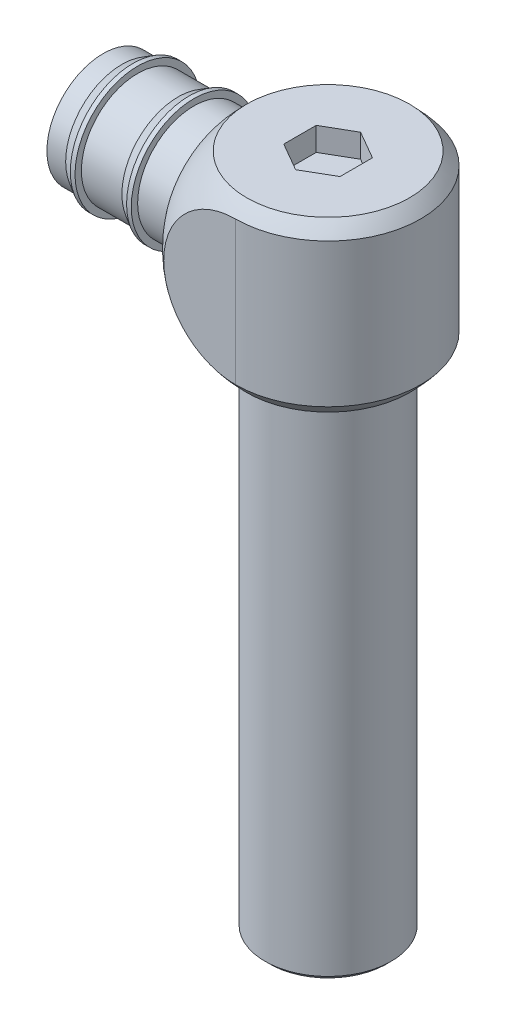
ISO-10303-21;
HEADER;
FILE_DESCRIPTION(('STEP AP214'),'2;1');
FILE_NAME('part.step','',(''),(''),'','','');
FILE_SCHEMA(('AUTOMOTIVE_DESIGN { 1 0 10303 214 1 1 1 1 }'));
ENDSEC;
DATA;
#1=APPLICATION_CONTEXT('core data for automotive mechanical design processes');
#2=APPLICATION_PROTOCOL_DEFINITION('international standard','automotive_design',2000,#1);
#3=PRODUCT_CONTEXT('',#1,'mechanical');
#4=PRODUCT('Part','Part','',(#3));
#5=PRODUCT_RELATED_PRODUCT_CATEGORY('part','',(#4));
#6=PRODUCT_DEFINITION_FORMATION('','',#4);
#7=PRODUCT_DEFINITION_CONTEXT('part definition',#1,'design');
#8=PRODUCT_DEFINITION('design','',#6,#7);
#9=PRODUCT_DEFINITION_SHAPE('','',#8);
#10=(LENGTH_UNIT() NAMED_UNIT(*) SI_UNIT(.MILLI.,.METRE.));
#11=(NAMED_UNIT(*) PLANE_ANGLE_UNIT() SI_UNIT($,.RADIAN.));
#12=(NAMED_UNIT(*) SI_UNIT($,.STERADIAN.) SOLID_ANGLE_UNIT());
#13=UNCERTAINTY_MEASURE_WITH_UNIT(LENGTH_MEASURE(1.E-05),#10,'distance_accuracy_value','');
#14=(GEOMETRIC_REPRESENTATION_CONTEXT(3) GLOBAL_UNCERTAINTY_ASSIGNED_CONTEXT((#13)) GLOBAL_UNIT_ASSIGNED_CONTEXT((#10,
#11,#12)) REPRESENTATION_CONTEXT('',''));
#15=CARTESIAN_POINT('',(0.,0.,0.));
#16=DIRECTION('',(0.,0.,1.));
#17=DIRECTION('',(1.,0.,0.));
#18=AXIS2_PLACEMENT_3D('',#15,#16,#17);
#19=CARTESIAN_POINT('',(0.,0.,0.));
#20=DIRECTION('',(1.,0.,0.));
#21=DIRECTION('',(0.,0.,-1.));
#22=AXIS2_PLACEMENT_3D('',#19,#20,#21);
#23=PLANE('',#22);
#24=CARTESIAN_POINT('',(0.,22.9489,0.));
#25=DIRECTION('',(1.,0.,0.));
#26=DIRECTION('',(0.,0.,-1.));
#27=AXIS2_PLACEMENT_3D('',#24,#25,#26);
#28=CIRCLE('',#27,8.255);
#29=CARTESIAN_POINT('',(0.,20.6814964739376,7.9375));
#30=VERTEX_POINT('',#29);
#31=CARTESIAN_POINT('',(0.,25.2163035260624,7.93749999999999));
#32=VERTEX_POINT('',#31);
#33=EDGE_CURVE('E218',#30,#32,#28,.F.);
#34=ORIENTED_EDGE('',*,*,#33,.T.);
#35=DIRECTION('',(0.,-1.,0.));
#36=VECTOR('',#35,1.);
#37=CARTESIAN_POINT('',(0.,31.2166,7.93749999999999));
#38=LINE('',#37,#36);
#39=EDGE_CURVE('E206',#32,#30,#38,.T.);
#40=ORIENTED_EDGE('',*,*,#39,.T.);
#41=EDGE_LOOP('',(#34,#40));
#42=FACE_BOUND('',#41,.T.);
#43=ADVANCED_FACE('F38',(#42),#23,.F.);
#44=CARTESIAN_POINT('',(-15.6845,3.10515,15.6845));
#45=DIRECTION('',(1.,0.,0.));
#46=DIRECTION('',(0.,0.,-1.));
#47=AXIS2_PLACEMENT_3D('',#44,#45,#46);
#48=PLANE('',#47);
#49=CARTESIAN_POINT('',(-15.6845,22.9489,0.));
#50=DIRECTION('',(1.,0.,0.));
#51=DIRECTION('',(0.,0.,-1.));
#52=AXIS2_PLACEMENT_3D('',#49,#50,#51);
#53=CIRCLE('',#52,10.715625);
#54=CARTESIAN_POINT('',(-15.6845,22.9489,-10.715625));
#55=VERTEX_POINT('',#54);
#56=EDGE_CURVE('E46',#55,#55,#53,.T.);
#57=ORIENTED_EDGE('',*,*,#56,.T.);
#58=EDGE_LOOP('',(#57));
#59=FACE_BOUND('',#58,.T.);
#60=CARTESIAN_POINT('',(-15.6845,22.9489,0.));
#61=DIRECTION('',(1.,0.,0.));
#62=DIRECTION('',(0.,0.,-1.));
#63=AXIS2_PLACEMENT_3D('',#60,#61,#62);
#64=CIRCLE('',#63,12.156104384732);
#65=CARTESIAN_POINT('',(-15.6845,22.9489,-12.156104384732));
#66=VERTEX_POINT('',#65);
#67=EDGE_CURVE('E254',#66,#66,#64,.F.);
#68=ORIENTED_EDGE('',*,*,#67,.T.);
#69=EDGE_LOOP('',(#68));
#70=FACE_BOUND('',#69,.T.);
#71=ADVANCED_FACE('F275',(#59,#70),#48,.F.);
#72=CARTESIAN_POINT('',(0.,22.9489,0.));
#73=DIRECTION('',(0.,-1.,0.));
#74=DIRECTION('',(1.,0.,0.));
#75=AXIS2_PLACEMENT_3D('',#72,#73,#74);
#76=SPHERICAL_SURFACE('',#75,19.84375);
#77=CARTESIAN_POINT('',(0.,8.6614,0.));
#78=DIRECTION('',(0.,-1.,0.));
#79=DIRECTION('',(1.,0.,0.));
#80=AXIS2_PLACEMENT_3D('',#77,#78,#79);
#81=CIRCLE('',#80,13.7710478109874);
#82=CARTESIAN_POINT('',(13.7710478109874,8.6614,0.));
#83=VERTEX_POINT('',#82);
#84=EDGE_CURVE('E246',#83,#83,#81,.F.);
#85=ORIENTED_EDGE('',*,*,#84,.T.);
#86=EDGE_LOOP('',(#85));
#87=FACE_BOUND('',#86,.T.);
#88=ORIENTED_EDGE('',*,*,#67,.F.);
#89=EDGE_LOOP('',(#88));
#90=FACE_BOUND('',#89,.T.);
#91=CARTESIAN_POINT('',(0.,22.9489,-15.6845));
#92=DIRECTION('',(0.,0.,1.));
#93=DIRECTION('',(1.,0.,0.));
#94=AXIS2_PLACEMENT_3D('',#91,#92,#93);
#95=CIRCLE('',#94,12.156104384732);
#96=CARTESIAN_POINT('',(0.,10.792795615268,-15.6845));
#97=VERTEX_POINT('',#96);
#98=CARTESIAN_POINT('',(0.,35.105004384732,-15.6845));
#99=VERTEX_POINT('',#98);
#100=EDGE_CURVE('E262',#97,#99,#95,.F.);
#101=ORIENTED_EDGE('',*,*,#100,.F.);
#102=CARTESIAN_POINT('',(0.,10.792795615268,0.));
#103=DIRECTION('',(0.,1.,0.));
#104=DIRECTION('',(0.,0.,1.));
#105=AXIS2_PLACEMENT_3D('',#102,#103,#104);
#106=CIRCLE('',#105,15.6845);
#107=CARTESIAN_POINT('',(0.,10.792795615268,15.6845));
#108=VERTEX_POINT('',#107);
#109=EDGE_CURVE('E260',#108,#97,#106,.T.);
#110=ORIENTED_EDGE('',*,*,#109,.F.);
#111=CARTESIAN_POINT('',(0.,22.9489,15.6845));
#112=DIRECTION('',(0.,0.,-1.));
#113=DIRECTION('',(-1.,0.,0.));
#114=AXIS2_PLACEMENT_3D('',#111,#112,#113);
#115=CIRCLE('',#114,12.156104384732);
#116=CARTESIAN_POINT('',(0.,35.105004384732,15.6845));
#117=VERTEX_POINT('',#116);
#118=EDGE_CURVE('E255',#117,#108,#115,.F.);
#119=ORIENTED_EDGE('',*,*,#118,.F.);
#120=CARTESIAN_POINT('',(0.,35.105004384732,0.));
#121=DIRECTION('',(0.,-1.,0.));
#122=DIRECTION('',(0.,0.,-1.));
#123=AXIS2_PLACEMENT_3D('',#120,#121,#122);
#124=CIRCLE('',#123,15.6845);
#125=EDGE_CURVE('E257',#99,#117,#124,.T.);
#126=ORIENTED_EDGE('',*,*,#125,.F.);
#127=EDGE_LOOP('',(#101,#110,#119,#126));
#128=FACE_BOUND('',#127,.T.);
#129=CARTESIAN_POINT('',(0.,37.2364,0.));
#130=DIRECTION('',(0.,1.,0.));
#131=DIRECTION('',(-1.,0.,0.));
#132=AXIS2_PLACEMENT_3D('',#129,#130,#131);
#133=CIRCLE('',#132,13.7710478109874);
#134=CARTESIAN_POINT('',(-13.7710478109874,37.2364,0.));
#135=VERTEX_POINT('',#134);
#136=EDGE_CURVE('E251',#135,#135,#133,.F.);
#137=ORIENTED_EDGE('',*,*,#136,.T.);
#138=EDGE_LOOP('',(#137));
#139=FACE_BOUND('',#138,.T.);
#140=ADVANCED_FACE('F312',(#87,#90,#128,#139),#76,.T.);
#141=CARTESIAN_POINT('',(0.,3.10515,-15.6845));
#142=DIRECTION('',(0.,0.,1.));
#143=DIRECTION('',(1.,0.,0.));
#144=AXIS2_PLACEMENT_3D('',#141,#142,#143);
#145=PLANE('',#144);
#146=ORIENTED_EDGE('',*,*,#100,.T.);
#147=DIRECTION('',(0.,-1.,0.));
#148=VECTOR('',#147,1.);
#149=CARTESIAN_POINT('',(0.,3.10515,-15.6845));
#150=LINE('',#149,#148);
#151=EDGE_CURVE('E250',#99,#97,#150,.T.);
#152=ORIENTED_EDGE('',*,*,#151,.T.);
#153=EDGE_LOOP('',(#146,#152));
#154=FACE_BOUND('',#153,.T.);
#155=ADVANCED_FACE('F382',(#154),#145,.F.);
#156=CARTESIAN_POINT('',(0.,3.10515,15.6845));
#157=DIRECTION('',(0.,0.,-1.));
#158=DIRECTION('',(-1.,0.,0.));
#159=AXIS2_PLACEMENT_3D('',#156,#157,#158);
#160=PLANE('',#159);
#161=ORIENTED_EDGE('',*,*,#118,.T.);
#162=DIRECTION('',(0.,-1.,0.));
#163=VECTOR('',#162,1.);
#164=CARTESIAN_POINT('',(0.,3.10515,15.6845));
#165=LINE('',#164,#163);
#166=EDGE_CURVE('E247',#117,#108,#165,.T.);
#167=ORIENTED_EDGE('',*,*,#166,.F.);
#168=EDGE_LOOP('',(#161,#167));
#169=FACE_BOUND('',#168,.T.);
#170=ADVANCED_FACE('F380',(#169),#160,.F.);
#171=CARTESIAN_POINT('',(0.,3.10515,0.));
#172=DIRECTION('',(0.,-1.,0.));
#173=DIRECTION('',(0.,0.,-1.));
#174=AXIS2_PLACEMENT_3D('',#171,#172,#173);
#175=CYLINDRICAL_SURFACE('',#174,15.6845);
#176=ORIENTED_EDGE('',*,*,#109,.T.);
#177=ORIENTED_EDGE('',*,*,#151,.F.);
#178=ORIENTED_EDGE('',*,*,#125,.T.);
#179=ORIENTED_EDGE('',*,*,#166,.T.);
#180=EDGE_LOOP('',(#176,#177,#178,#179));
#181=FACE_BOUND('',#180,.T.);
#182=ADVANCED_FACE('F378',(#181),#175,.T.);
#183=CARTESIAN_POINT('',(-25.4,8.6614,-15.6845));
#184=DIRECTION('',(0.,-1.,0.));
#185=DIRECTION('',(1.,0.,0.));
#186=AXIS2_PLACEMENT_3D('',#183,#184,#185);
#187=PLANE('',#186);
#188=CARTESIAN_POINT('',(0.,8.6614,0.));
#189=DIRECTION('',(0.,-1.,0.));
#190=DIRECTION('',(1.,0.,0.));
#191=AXIS2_PLACEMENT_3D('',#188,#189,#190);
#192=CIRCLE('',#191,10.668);
#193=CARTESIAN_POINT('',(10.668,8.6614,0.));
#194=VERTEX_POINT('',#193);
#195=EDGE_CURVE('E12',#194,#194,#192,.T.);
#196=ORIENTED_EDGE('',*,*,#195,.F.);
#197=EDGE_LOOP('',(#196));
#198=FACE_BOUND('',#197,.T.);
#199=ORIENTED_EDGE('',*,*,#84,.F.);
#200=EDGE_LOOP('',(#199));
#201=FACE_BOUND('',#200,.T.);
#202=ADVANCED_FACE('F374',(#198,#201),#187,.T.);
#203=CARTESIAN_POINT('',(-25.4,37.2364,-15.6845));
#204=DIRECTION('',(0.,1.,0.));
#205=DIRECTION('',(-1.,0.,0.));
#206=AXIS2_PLACEMENT_3D('',#203,#204,#205);
#207=PLANE('',#206);
#208=DIRECTION('',(0.866025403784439,0.,-0.5));
#209=VECTOR('',#208,1.);
#210=CARTESIAN_POINT('',(0.,37.2364,5.49926131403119));
#211=LINE('',#210,#209);
#212=CARTESIAN_POINT('',(0.,37.2364,5.49926131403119));
#213=VERTEX_POINT('',#212);
#214=CARTESIAN_POINT('',(4.7625,37.2364,2.74963065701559));
#215=VERTEX_POINT('',#214);
#216=EDGE_CURVE('E53',#213,#215,#211,.T.);
#217=ORIENTED_EDGE('',*,*,#216,.F.);
#218=DIRECTION('',(0.866025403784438,0.,0.5));
#219=VECTOR('',#218,1.);
#220=CARTESIAN_POINT('',(-4.76249999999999,37.2364,2.74963065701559));
#221=LINE('',#220,#219);
#222=CARTESIAN_POINT('',(-4.76249999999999,37.2364,2.74963065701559));
#223=VERTEX_POINT('',#222);
#224=EDGE_CURVE('E136',#223,#213,#221,.T.);
#225=ORIENTED_EDGE('',*,*,#224,.F.);
#226=DIRECTION('',(0.,0.,1.));
#227=VECTOR('',#226,1.);
#228=CARTESIAN_POINT('',(-4.76249999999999,37.2364,-2.74963065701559));
#229=LINE('',#228,#227);
#230=CARTESIAN_POINT('',(-4.76249999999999,37.2364,-2.74963065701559));
#231=VERTEX_POINT('',#230);
#232=EDGE_CURVE('E139',#231,#223,#229,.T.);
#233=ORIENTED_EDGE('',*,*,#232,.F.);
#234=DIRECTION('',(-0.866025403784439,0.,0.5));
#235=VECTOR('',#234,1.);
#236=CARTESIAN_POINT('',(0.,37.2364,-5.49926131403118));
#237=LINE('',#236,#235);
#238=CARTESIAN_POINT('',(0.,37.2364,-5.49926131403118));
#239=VERTEX_POINT('',#238);
#240=EDGE_CURVE('E155',#239,#231,#237,.T.);
#241=ORIENTED_EDGE('',*,*,#240,.F.);
#242=DIRECTION('',(-0.866025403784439,0.,-0.5));
#243=VECTOR('',#242,1.);
#244=CARTESIAN_POINT('',(4.7625,37.2364,-2.74963065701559));
#245=LINE('',#244,#243);
#246=CARTESIAN_POINT('',(4.7625,37.2364,-2.74963065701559));
#247=VERTEX_POINT('',#246);
#248=EDGE_CURVE('E152',#247,#239,#245,.T.);
#249=ORIENTED_EDGE('',*,*,#248,.F.);
#250=DIRECTION('',(0.,0.,-1.));
#251=VECTOR('',#250,1.);
#252=CARTESIAN_POINT('',(4.7625,37.2364,2.74963065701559));
#253=LINE('',#252,#251);
#254=EDGE_CURVE('E150',#215,#247,#253,.T.);
#255=ORIENTED_EDGE('',*,*,#254,.F.);
#256=EDGE_LOOP('',(#217,#225,#233,#241,#249,#255));
#257=FACE_BOUND('',#256,.T.);
#258=ORIENTED_EDGE('',*,*,#136,.F.);
#259=EDGE_LOOP('',(#258));
#260=FACE_BOUND('',#259,.T.);
#261=ADVANCED_FACE('F288',(#257,#260),#207,.T.);
#262=CARTESIAN_POINT('',(0.,22.9489,0.));
#263=DIRECTION('',(-1.,0.,0.));
#264=DIRECTION('',(0.,0.,1.));
#265=AXIS2_PLACEMENT_3D('',#262,#263,#264);
#266=CYLINDRICAL_SURFACE('',#265,9.525);
#267=CARTESIAN_POINT('',(-16.875125,22.9489,0.));
#268=DIRECTION('',(1.,0.,0.));
#269=DIRECTION('',(0.,0.,-1.));
#270=AXIS2_PLACEMENT_3D('',#267,#268,#269);
#271=CIRCLE('',#270,9.525);
#272=CARTESIAN_POINT('',(-16.875125,22.9489,-9.525));
#273=VERTEX_POINT('',#272);
#274=EDGE_CURVE('E264',#273,#273,#271,.F.);
#275=ORIENTED_EDGE('',*,*,#274,.T.);
#276=EDGE_LOOP('',(#275));
#277=FACE_BOUND('',#276,.T.);
#278=CARTESIAN_POINT('',(-22.7365011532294,22.9489,0.));
#279=DIRECTION('',(-1.,0.,0.));
#280=DIRECTION('',(0.,0.,1.));
#281=AXIS2_PLACEMENT_3D('',#278,#279,#280);
#282=CIRCLE('',#281,9.525);
#283=CARTESIAN_POINT('',(-22.7365011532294,22.9489,9.525));
#284=VERTEX_POINT('',#283);
#285=EDGE_CURVE('E222',#284,#284,#282,.T.);
#286=ORIENTED_EDGE('',*,*,#285,.F.);
#287=EDGE_LOOP('',(#286));
#288=FACE_BOUND('',#287,.T.);
#289=ADVANCED_FACE('F284',(#277,#288),#266,.T.);
#290=CARTESIAN_POINT('',(0.,22.9489,0.));
#291=DIRECTION('',(-1.,0.,0.));
#292=DIRECTION('',(0.,0.,1.));
#293=AXIS2_PLACEMENT_3D('',#290,#291,#292);
#294=CYLINDRICAL_SURFACE('',#293,9.525);
#295=CARTESIAN_POINT('',(-38.1,22.9489,0.));
#296=DIRECTION('',(-1.,0.,0.));
#297=DIRECTION('',(0.,0.,1.));
#298=AXIS2_PLACEMENT_3D('',#295,#296,#297);
#299=CIRCLE('',#298,9.525);
#300=CARTESIAN_POINT('',(-38.1,22.9489,9.525));
#301=VERTEX_POINT('',#300);
#302=EDGE_CURVE('E219',#301,#301,#299,.T.);
#303=ORIENTED_EDGE('',*,*,#302,.F.);
#304=EDGE_LOOP('',(#303));
#305=FACE_BOUND('',#304,.T.);
#306=CARTESIAN_POINT('',(-34.925,22.9489,0.));
#307=DIRECTION('',(-1.,0.,0.));
#308=DIRECTION('',(0.,0.,1.));
#309=AXIS2_PLACEMENT_3D('',#306,#307,#308);
#310=CIRCLE('',#309,9.525);
#311=CARTESIAN_POINT('',(-34.925,22.9489,9.525));
#312=VERTEX_POINT('',#311);
#313=EDGE_CURVE('E243',#312,#312,#310,.T.);
#314=ORIENTED_EDGE('',*,*,#313,.T.);
#315=EDGE_LOOP('',(#314));
#316=FACE_BOUND('',#315,.T.);
#317=ADVANCED_FACE('F287',(#305,#316),#294,.T.);
#318=CARTESIAN_POINT('',(-33.0552511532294,22.9489,0.));
#319=DIRECTION('',(1.,0.,0.));
#320=DIRECTION('',(0.,0.,-1.));
#321=AXIS2_PLACEMENT_3D('',#318,#319,#320);
#322=CONICAL_SURFACE('',#321,10.6045,0.523598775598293);
#323=ORIENTED_EDGE('',*,*,#313,.F.);
#324=EDGE_LOOP('',(#323));
#325=FACE_BOUND('',#324,.T.);
#326=CARTESIAN_POINT('',(-33.0552511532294,22.9489,0.));
#327=DIRECTION('',(-1.,0.,0.));
#328=DIRECTION('',(0.,0.,1.));
#329=AXIS2_PLACEMENT_3D('',#326,#327,#328);
#330=CIRCLE('',#329,10.6045);
#331=CARTESIAN_POINT('',(-33.0552511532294,22.9489,10.6045));
#332=VERTEX_POINT('',#331);
#333=EDGE_CURVE('E240',#332,#332,#330,.T.);
#334=ORIENTED_EDGE('',*,*,#333,.T.);
#335=EDGE_LOOP('',(#334));
#336=FACE_BOUND('',#335,.T.);
#337=ADVANCED_FACE('F337',(#325,#336),#322,.T.);
#338=CARTESIAN_POINT('',(0.,22.9489,0.));
#339=DIRECTION('',(-1.,0.,0.));
#340=DIRECTION('',(0.,0.,1.));
#341=AXIS2_PLACEMENT_3D('',#338,#339,#340);
#342=CYLINDRICAL_SURFACE('',#341,10.6045);
#343=ORIENTED_EDGE('',*,*,#333,.F.);
#344=EDGE_LOOP('',(#343));
#345=FACE_BOUND('',#344,.T.);
#346=CARTESIAN_POINT('',(-32.2615011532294,22.9489,0.));
#347=DIRECTION('',(-1.,0.,0.));
#348=DIRECTION('',(0.,0.,1.));
#349=AXIS2_PLACEMENT_3D('',#346,#347,#348);
#350=CIRCLE('',#349,10.6045);
#351=CARTESIAN_POINT('',(-32.2615011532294,22.9489,10.6045));
#352=VERTEX_POINT('',#351);
#353=EDGE_CURVE('E237',#352,#352,#350,.T.);
#354=ORIENTED_EDGE('',*,*,#353,.T.);
#355=EDGE_LOOP('',(#354));
#356=FACE_BOUND('',#355,.T.);
#357=ADVANCED_FACE('F343',(#345,#356),#342,.T.);
#358=CARTESIAN_POINT('',(-32.2615011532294,22.9489,-10.6045));
#359=DIRECTION('',(-1.,0.,0.));
#360=DIRECTION('',(0.,0.,1.));
#361=AXIS2_PLACEMENT_3D('',#358,#359,#360);
#362=PLANE('',#361);
#363=ORIENTED_EDGE('',*,*,#353,.F.);
#364=EDGE_LOOP('',(#363));
#365=FACE_BOUND('',#364,.T.);
#366=CARTESIAN_POINT('',(-32.2615011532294,22.9489,0.));
#367=DIRECTION('',(-1.,0.,0.));
#368=DIRECTION('',(0.,0.,1.));
#369=AXIS2_PLACEMENT_3D('',#366,#367,#368);
#370=CIRCLE('',#369,9.525);
#371=CARTESIAN_POINT('',(-32.2615011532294,22.9489,9.525));
#372=VERTEX_POINT('',#371);
#373=EDGE_CURVE('E234',#372,#372,#370,.T.);
#374=ORIENTED_EDGE('',*,*,#373,.T.);
#375=EDGE_LOOP('',(#374));
#376=FACE_BOUND('',#375,.T.);
#377=ADVANCED_FACE('F349',(#365,#376),#362,.F.);
#378=CARTESIAN_POINT('',(0.,22.9489,0.));
#379=DIRECTION('',(-1.,0.,0.));
#380=DIRECTION('',(0.,0.,1.));
#381=AXIS2_PLACEMENT_3D('',#378,#379,#380);
#382=CYLINDRICAL_SURFACE('',#381,9.525);
#383=ORIENTED_EDGE('',*,*,#373,.F.);
#384=EDGE_LOOP('',(#383));
#385=FACE_BOUND('',#384,.T.);
#386=CARTESIAN_POINT('',(-25.4,22.9489,0.));
#387=DIRECTION('',(-1.,0.,0.));
#388=DIRECTION('',(0.,0.,1.));
#389=AXIS2_PLACEMENT_3D('',#386,#387,#388);
#390=CIRCLE('',#389,9.525);
#391=CARTESIAN_POINT('',(-25.4,22.9489,9.525));
#392=VERTEX_POINT('',#391);
#393=EDGE_CURVE('E231',#392,#392,#390,.T.);
#394=ORIENTED_EDGE('',*,*,#393,.T.);
#395=EDGE_LOOP('',(#394));
#396=FACE_BOUND('',#395,.T.);
#397=ADVANCED_FACE('F355',(#385,#396),#382,.T.);
#398=CARTESIAN_POINT('',(-23.5302511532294,22.9489,0.));
#399=DIRECTION('',(1.,0.,0.));
#400=DIRECTION('',(0.,0.,-1.));
#401=AXIS2_PLACEMENT_3D('',#398,#399,#400);
#402=CONICAL_SURFACE('',#401,10.6045,0.523598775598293);
#403=ORIENTED_EDGE('',*,*,#393,.F.);
#404=EDGE_LOOP('',(#403));
#405=FACE_BOUND('',#404,.T.);
#406=CARTESIAN_POINT('',(-23.5302511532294,22.9489,0.));
#407=DIRECTION('',(-1.,0.,0.));
#408=DIRECTION('',(0.,0.,1.));
#409=AXIS2_PLACEMENT_3D('',#406,#407,#408);
#410=CIRCLE('',#409,10.6045);
#411=CARTESIAN_POINT('',(-23.5302511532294,22.9489,10.6045));
#412=VERTEX_POINT('',#411);
#413=EDGE_CURVE('E228',#412,#412,#410,.T.);
#414=ORIENTED_EDGE('',*,*,#413,.T.);
#415=EDGE_LOOP('',(#414));
#416=FACE_BOUND('',#415,.T.);
#417=ADVANCED_FACE('F303',(#405,#416),#402,.T.);
#418=CARTESIAN_POINT('',(0.,22.9489,0.));
#419=DIRECTION('',(-1.,0.,0.));
#420=DIRECTION('',(0.,0.,1.));
#421=AXIS2_PLACEMENT_3D('',#418,#419,#420);
#422=CYLINDRICAL_SURFACE('',#421,10.6045);
#423=ORIENTED_EDGE('',*,*,#413,.F.);
#424=EDGE_LOOP('',(#423));
#425=FACE_BOUND('',#424,.T.);
#426=CARTESIAN_POINT('',(-22.7365011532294,22.9489,0.));
#427=DIRECTION('',(-1.,0.,0.));
#428=DIRECTION('',(0.,0.,1.));
#429=AXIS2_PLACEMENT_3D('',#426,#427,#428);
#430=CIRCLE('',#429,10.6045);
#431=CARTESIAN_POINT('',(-22.7365011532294,22.9489,10.6045));
#432=VERTEX_POINT('',#431);
#433=EDGE_CURVE('E225',#432,#432,#430,.T.);
#434=ORIENTED_EDGE('',*,*,#433,.T.);
#435=EDGE_LOOP('',(#434));
#436=FACE_BOUND('',#435,.T.);
#437=ADVANCED_FACE('F294',(#425,#436),#422,.T.);
#438=CARTESIAN_POINT('',(-22.7365011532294,22.9489,-10.6045));
#439=DIRECTION('',(-1.,0.,0.));
#440=DIRECTION('',(0.,0.,1.));
#441=AXIS2_PLACEMENT_3D('',#438,#439,#440);
#442=PLANE('',#441);
#443=ORIENTED_EDGE('',*,*,#433,.F.);
#444=EDGE_LOOP('',(#443));
#445=FACE_BOUND('',#444,.T.);
#446=ORIENTED_EDGE('',*,*,#285,.T.);
#447=EDGE_LOOP('',(#446));
#448=FACE_BOUND('',#447,.T.);
#449=ADVANCED_FACE('F292',(#445,#448),#442,.F.);
#450=CARTESIAN_POINT('',(-38.1,22.9489,0.));
#451=DIRECTION('',(1.,0.,0.));
#452=DIRECTION('',(0.,0.,-1.));
#453=AXIS2_PLACEMENT_3D('',#450,#451,#452);
#454=PLANE('',#453);
#455=CARTESIAN_POINT('',(-38.1,22.9489,0.));
#456=DIRECTION('',(-1.,0.,0.));
#457=DIRECTION('',(0.,0.,1.));
#458=AXIS2_PLACEMENT_3D('',#455,#456,#457);
#459=CIRCLE('',#458,8.255);
#460=CARTESIAN_POINT('',(-38.1,22.9489,8.255));
#461=VERTEX_POINT('',#460);
#462=EDGE_CURVE('E212',#461,#461,#459,.T.);
#463=ORIENTED_EDGE('',*,*,#462,.F.);
#464=EDGE_LOOP('',(#463));
#465=FACE_BOUND('',#464,.T.);
#466=ORIENTED_EDGE('',*,*,#302,.T.);
#467=EDGE_LOOP('',(#466));
#468=FACE_BOUND('',#467,.T.);
#469=ADVANCED_FACE('F281',(#465,#468),#454,.F.);
#470=CARTESIAN_POINT('',(-16.875125,22.9489,0.));
#471=DIRECTION('',(1.,0.,0.));
#472=DIRECTION('',(0.,0.,-1.));
#473=AXIS2_PLACEMENT_3D('',#470,#471,#472);
#474=TOROIDAL_SURFACE('',#473,10.715625,1.190625);
#475=ORIENTED_EDGE('',*,*,#56,.F.);
#476=EDGE_LOOP('',(#475));
#477=FACE_BOUND('',#476,.T.);
#478=ORIENTED_EDGE('',*,*,#274,.F.);
#479=EDGE_LOOP('',(#478));
#480=FACE_BOUND('',#479,.T.);
#481=ADVANCED_FACE('F40',(#477,#480),#474,.F.);
#482=CARTESIAN_POINT('',(0.,25.2163035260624,-7.93749999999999));
#483=VERTEX_POINT('',#482);
#484=CARTESIAN_POINT('',(0.,20.6814964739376,-7.9375));
#485=VERTEX_POINT('',#484);
#486=EDGE_CURVE('E215',#483,#485,#28,.F.);
#487=ORIENTED_EDGE('',*,*,#486,.T.);
#488=DIRECTION('',(0.,-1.,0.));
#489=VECTOR('',#488,1.);
#490=CARTESIAN_POINT('',(0.,31.2166,-7.93749999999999));
#491=LINE('',#490,#489);
#492=EDGE_CURVE('E61',#485,#483,#491,.F.);
#493=ORIENTED_EDGE('',*,*,#492,.T.);
#494=EDGE_LOOP('',(#487,#493));
#495=FACE_BOUND('',#494,.T.);
#496=ADVANCED_FACE('F280',(#495),#23,.F.);
#497=CARTESIAN_POINT('',(23.3486659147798,22.9489,0.));
#498=DIRECTION('',(-1.,0.,0.));
#499=DIRECTION('',(0.,0.,1.));
#500=AXIS2_PLACEMENT_3D('',#497,#498,#499);
#501=CYLINDRICAL_SURFACE('',#500,8.255);
#502=ORIENTED_EDGE('',*,*,#462,.T.);
#503=EDGE_LOOP('',(#502));
#504=FACE_BOUND('',#503,.T.);
#505=ORIENTED_EDGE('',*,*,#486,.F.);
#506=CARTESIAN_POINT('',(0.,25.2163035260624,-7.9375));
#507=CARTESIAN_POINT('',(-0.0748735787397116,25.2162247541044,-7.93751235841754));
#508=CARTESIAN_POINT('',(-0.149692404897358,25.220010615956,-7.93644115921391));
#509=CARTESIAN_POINT('',(-0.298368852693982,25.2346779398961,-7.93223447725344));
#510=CARTESIAN_POINT('',(-0.372228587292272,25.2455393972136,-7.92910481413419));
#511=CARTESIAN_POINT('',(-0.517142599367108,25.2734569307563,-7.92096285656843));
#512=CARTESIAN_POINT('',(-0.58822350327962,25.2903885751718,-7.91598831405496));
#513=CARTESIAN_POINT('',(-0.728783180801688,25.3295911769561,-7.90428723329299));
#514=CARTESIAN_POINT('',(-0.798260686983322,25.3518662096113,-7.89755935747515));
#515=CARTESIAN_POINT('',(-0.979823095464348,25.4166957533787,-7.87761231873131));
#516=CARTESIAN_POINT('',(-1.09039675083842,25.4630475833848,-7.86300937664));
#517=CARTESIAN_POINT('',(-1.30695356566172,25.5642517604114,-7.82992968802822));
#518=CARTESIAN_POINT('',(-1.41293314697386,25.619110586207,-7.81144998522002));
#519=CARTESIAN_POINT('',(-1.62211484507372,25.7354274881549,-7.77072284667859));
#520=CARTESIAN_POINT('',(-1.72526892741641,25.7969563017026,-7.74843320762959));
#521=CARTESIAN_POINT('',(-1.92814904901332,25.9242394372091,-7.70045549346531));
#522=CARTESIAN_POINT('',(-2.02787363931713,25.9899955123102,-7.67476600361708));
#523=CARTESIAN_POINT('',(-2.24224481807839,26.1366256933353,-7.61516721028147));
#524=CARTESIAN_POINT('',(-2.3563148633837,26.2180776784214,-7.58061226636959));
#525=CARTESIAN_POINT('',(-2.58106999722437,26.3836200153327,-7.50706004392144));
#526=CARTESIAN_POINT('',(-2.69175433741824,26.4677109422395,-7.46806179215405));
#527=CARTESIAN_POINT('',(-3.01961785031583,26.7225039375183,-7.34441996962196));
#528=CARTESIAN_POINT('',(-3.23246266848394,26.8956233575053,-7.25317013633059));
#529=CARTESIAN_POINT('',(-3.6479642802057,27.2426104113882,-7.05330919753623));
#530=CARTESIAN_POINT('',(-3.85064815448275,27.4164745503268,-6.94474786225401));
#531=CARTESIAN_POINT('',(-4.24695471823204,27.7622546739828,-6.70971854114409));
#532=CARTESIAN_POINT('',(-4.44058139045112,27.9341714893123,-6.58325852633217));
#533=CARTESIAN_POINT('',(-4.80874402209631,28.26481643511,-6.31890223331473));
#534=CARTESIAN_POINT('',(-4.98374929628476,28.4237662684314,-6.18193861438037));
#535=CARTESIAN_POINT('',(-5.32463290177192,28.735792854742,-5.89087719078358));
#536=CARTESIAN_POINT('',(-5.49050968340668,28.8888686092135,-5.73677649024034));
#537=CARTESIAN_POINT('',(-5.81168241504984,29.1869452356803,-5.41114165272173));
#538=CARTESIAN_POINT('',(-5.96699003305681,29.3319549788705,-5.23962727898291));
#539=CARTESIAN_POINT('',(-6.26550124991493,29.6118527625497,-4.8787610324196));
#540=CARTESIAN_POINT('',(-6.40870417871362,29.7467402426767,-4.68940817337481));
#541=CARTESIAN_POINT('',(-6.74388362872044,30.0634501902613,-4.20087935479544));
#542=CARTESIAN_POINT('',(-6.92789319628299,30.2382265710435,-3.89133037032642));
#543=CARTESIAN_POINT('',(-7.17478007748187,30.4733916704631,-3.40001379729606));
#544=CARTESIAN_POINT('',(-7.25221039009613,30.547269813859,-3.23177378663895));
#545=CARTESIAN_POINT('',(-7.39632775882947,30.6849406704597,-2.88671909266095));
#546=CARTESIAN_POINT('',(-7.4630163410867,30.7487348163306,-2.70990563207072));
#547=CARTESIAN_POINT('',(-7.57538430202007,30.8563234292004,-2.3756560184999));
#548=CARTESIAN_POINT('',(-7.62271406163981,30.9016820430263,-2.21927514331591));
#549=CARTESIAN_POINT('',(-7.70806908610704,30.9835313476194,-1.90173360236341));
#550=CARTESIAN_POINT('',(-7.74609601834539,31.0200236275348,-1.74057379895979));
#551=CARTESIAN_POINT('',(-7.81222903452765,31.0835146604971,-1.4144454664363));
#552=CARTESIAN_POINT('',(-7.84033867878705,31.1105168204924,-1.24947832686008));
#553=CARTESIAN_POINT('',(-7.88616601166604,31.1545500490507,-0.916780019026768));
#554=CARTESIAN_POINT('',(-7.90388358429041,31.1715810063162,-0.749048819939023));
#555=CARTESIAN_POINT('',(-7.92863426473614,31.1953749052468,-0.411556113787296));
#556=CARTESIAN_POINT('',(-7.93563479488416,31.2021065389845,-0.241789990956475));
#557=CARTESIAN_POINT('',(-7.93871339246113,31.2050667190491,0.0979337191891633));
#558=CARTESIAN_POINT('',(-7.93479144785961,31.2012952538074,0.267891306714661));
#559=CARTESIAN_POINT('',(-7.91610042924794,31.1833251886,0.60666669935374));
#560=CARTESIAN_POINT('',(-7.90133028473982,31.1691255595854,0.77548439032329));
#561=CARTESIAN_POINT('',(-7.86122064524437,31.1305794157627,1.11067922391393));
#562=CARTESIAN_POINT('',(-7.83588123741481,31.1062329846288,1.27705638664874));
#563=CARTESIAN_POINT('',(-7.77646788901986,31.0491781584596,1.59874552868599));
#564=CARTESIAN_POINT('',(-7.74284186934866,31.0168987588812,1.75421724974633));
#565=CARTESIAN_POINT('',(-7.66686782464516,30.9440151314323,2.06107725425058));
#566=CARTESIAN_POINT('',(-7.62451648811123,30.9034077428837,2.21246396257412));
#567=CARTESIAN_POINT('',(-7.5316868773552,30.814473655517,2.51036617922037));
#568=CARTESIAN_POINT('',(-7.48120958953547,30.7661478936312,2.65688227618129));
#569=CARTESIAN_POINT('',(-7.37273844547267,30.6624037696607,2.94453297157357));
#570=CARTESIAN_POINT('',(-7.31474306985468,30.6069839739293,3.08566647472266));
#571=CARTESIAN_POINT('',(-7.167856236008,30.4667873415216,3.41613510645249));
#572=CARTESIAN_POINT('',(-7.0757433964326,30.378997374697,3.60277230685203));
#573=CARTESIAN_POINT('',(-6.87980620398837,30.192651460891,3.96414650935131));
#574=CARTESIAN_POINT('',(-6.77597814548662,30.0940921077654,4.13887971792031));
#575=CARTESIAN_POINT('',(-6.55786222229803,29.8875913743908,4.47647438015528));
#576=CARTESIAN_POINT('',(-6.44355189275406,29.7796298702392,4.63930892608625));
#577=CARTESIAN_POINT('',(-6.20597655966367,29.5559915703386,4.95261762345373));
#578=CARTESIAN_POINT('',(-6.0827114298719,29.4403146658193,5.1030916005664));
#579=CARTESIAN_POINT('',(-5.78209834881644,29.1593712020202,5.44426844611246));
#580=CARTESIAN_POINT('',(-5.60136628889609,28.9913515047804,5.62973600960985));
#581=CARTESIAN_POINT('',(-5.22742361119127,28.6464299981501,5.97857714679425));
#582=CARTESIAN_POINT('',(-5.03420734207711,28.4695241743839,6.14194060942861));
#583=CARTESIAN_POINT('',(-4.63708556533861,28.1099602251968,6.44701163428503));
#584=CARTESIAN_POINT('',(-4.43319572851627,27.9273106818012,6.58874981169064));
#585=CARTESIAN_POINT('',(-4.01523463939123,27.5590476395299,6.85147523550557));
#586=CARTESIAN_POINT('',(-3.80116754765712,27.3734353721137,6.97247087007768));
#587=CARTESIAN_POINT('',(-3.35733000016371,26.9983567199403,7.19691781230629));
#588=CARTESIAN_POINT('',(-3.12731078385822,26.8089005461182,7.29989832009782));
#589=CARTESIAN_POINT('',(-2.7719363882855,26.5293329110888,7.43884846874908));
#590=CARTESIAN_POINT('',(-2.65153216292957,26.4367537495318,7.48264195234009));
#591=CARTESIAN_POINT('',(-2.406770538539,26.2544917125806,7.56492259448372));
#592=CARTESIAN_POINT('',(-2.28241365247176,26.164808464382,7.60341043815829));
#593=CARTESIAN_POINT('',(-2.0568700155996,26.0094106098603,7.66705422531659));
#594=CARTESIAN_POINT('',(-1.95662287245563,25.942772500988,7.69327829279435));
#595=CARTESIAN_POINT('',(-1.75268437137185,25.813648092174,7.74228663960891));
#596=CARTESIAN_POINT('',(-1.64899408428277,25.751160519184,7.76507197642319));
#597=CARTESIAN_POINT('',(-1.43853797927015,25.6327427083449,7.80678635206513));
#598=CARTESIAN_POINT('',(-1.33181275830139,25.5767536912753,7.82575132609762));
#599=CARTESIAN_POINT('',(-1.11370744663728,25.4732345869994,7.85975331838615));
#600=CARTESIAN_POINT('',(-1.00233087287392,25.4256982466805,7.87479324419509));
#601=CARTESIAN_POINT('',(-0.818266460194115,25.3585507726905,7.89552638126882));
#602=CARTESIAN_POINT('',(-0.747096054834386,25.3352168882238,7.90259330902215));
#603=CARTESIAN_POINT('',(-0.603047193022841,25.2941115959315,7.914888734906));
#604=CARTESIAN_POINT('',(-0.53017017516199,25.2763356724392,7.92011872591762));
#605=CARTESIAN_POINT('',(-0.381627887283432,25.2470291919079,7.92867461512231));
#606=CARTESIAN_POINT('',(-0.305935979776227,25.2356200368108,7.93196356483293));
#607=CARTESIAN_POINT('',(-0.153518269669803,25.2202028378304,7.93638629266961));
#608=CARTESIAN_POINT('',(-0.0767900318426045,25.2162172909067,7.93751352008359));
#609=CARTESIAN_POINT('',(4.81263444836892E-13,25.2163035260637,7.93750000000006));
#610=B_SPLINE_CURVE_WITH_KNOTS('',3,(#506,#507,#508,#509,#510,#511,#512,#513,#514,#515,#516,
#517,#518,#519,#520,#521,#522,#523,#524,#525,#526,#527,#528,#529,#530,#531,#532,#533,#534,#535,
#536,#537,#538,#539,#540,#541,#542,#543,#544,#545,#546,#547,#548,#549,#550,#551,#552,#553,#554,
#555,#556,#557,#558,#559,#560,#561,#562,#563,#564,#565,#566,#567,#568,#569,#570,#571,#572,#573,
#574,#575,#576,#577,#578,#579,#580,#581,#582,#583,#584,#585,#586,#587,#588,#589,#590,#591,#592,
#593,#594,#595,#596,#597,#598,#599,#600,#601,#602,#603,#604,#605,#606,#607,#608,#609),
.UNSPECIFIED.,.F.,.F.,(4,2,2,2,2,2,2,2,2,2,2,2,2,2,2,2,2,2,2,2,2,2,2,2,2,2,2,2,2,2,2,2,2,2,2,2,
2,2,2,2,2,2,2,2,2,2,2,2,2,2,2,4),(0.,0.224430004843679,0.448228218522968,0.667679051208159,
0.88729778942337,1.24898348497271,1.61094599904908,1.97721414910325,2.34363519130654,
2.77655706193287,3.20957393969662,4.07615303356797,4.94028421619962,5.80403176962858,
6.62300417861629,7.44211519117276,8.26030674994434,9.07854356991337,10.2741639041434,
10.8717700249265,11.4692911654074,11.9774764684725,12.4855706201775,12.9934821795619,
13.5013994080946,14.0108575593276,14.5203162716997,15.0298252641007,15.5393300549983,
16.025742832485,16.5123405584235,16.9988792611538,17.4855164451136,18.1621790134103,
18.8390562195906,19.5174195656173,20.1957924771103,21.1205187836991,22.0456666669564,
22.9694924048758,23.8929436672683,24.8377650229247,25.3118531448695,25.7858799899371,
26.1553486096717,26.5247033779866,26.8904025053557,27.2558299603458,27.4813182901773,
27.7066229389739,27.9360885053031,28.1662483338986),.UNSPECIFIED.);
#611=EDGE_CURVE('E199',#483,#32,#610,.T.);
#612=ORIENTED_EDGE('',*,*,#611,.T.);
#613=ORIENTED_EDGE('',*,*,#33,.F.);
#614=CARTESIAN_POINT('',(0.,20.6814964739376,7.9375));
#615=CARTESIAN_POINT('',(-0.0748735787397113,20.6815752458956,7.93751235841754));
#616=CARTESIAN_POINT('',(-0.149692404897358,20.677789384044,7.93644115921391));
#617=CARTESIAN_POINT('',(-0.298368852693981,20.6631220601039,7.93223447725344));
#618=CARTESIAN_POINT('',(-0.372228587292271,20.6522606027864,7.92910481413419));
#619=CARTESIAN_POINT('',(-0.517142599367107,20.6243430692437,7.92096285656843));
#620=CARTESIAN_POINT('',(-0.588223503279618,20.6074114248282,7.91598831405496));
#621=CARTESIAN_POINT('',(-0.728783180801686,20.5682088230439,7.90428723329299));
#622=CARTESIAN_POINT('',(-0.79826068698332,20.5459337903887,7.89755935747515));
#623=CARTESIAN_POINT('',(-0.979823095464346,20.4811042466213,7.87761231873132));
#624=CARTESIAN_POINT('',(-1.09039675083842,20.4347524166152,7.86300937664));
#625=CARTESIAN_POINT('',(-1.30695356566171,20.3335482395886,7.82992968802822));
#626=CARTESIAN_POINT('',(-1.41293314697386,20.278689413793,7.81144998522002));
#627=CARTESIAN_POINT('',(-1.62211484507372,20.1623725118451,7.77072284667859));
#628=CARTESIAN_POINT('',(-1.7252689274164,20.1008436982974,7.74843320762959));
#629=CARTESIAN_POINT('',(-1.92814904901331,19.9735605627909,7.70045549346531));
#630=CARTESIAN_POINT('',(-2.02787363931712,19.9078044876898,7.67476600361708));
#631=CARTESIAN_POINT('',(-2.24224481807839,19.7611743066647,7.61516721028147));
#632=CARTESIAN_POINT('',(-2.3563148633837,19.6797223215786,7.58061226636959));
#633=CARTESIAN_POINT('',(-2.58106999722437,19.5141799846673,7.50706004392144));
#634=CARTESIAN_POINT('',(-2.69175433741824,19.4300890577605,7.46806179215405));
#635=CARTESIAN_POINT('',(-3.01961785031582,19.1752960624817,7.34441996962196));
#636=CARTESIAN_POINT('',(-3.23246266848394,19.0021766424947,7.25317013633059));
#637=CARTESIAN_POINT('',(-3.6479642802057,18.6551895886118,7.05330919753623));
#638=CARTESIAN_POINT('',(-3.85064815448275,18.4813254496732,6.94474786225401));
#639=CARTESIAN_POINT('',(-4.24695471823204,18.1355453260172,6.70971854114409));
#640=CARTESIAN_POINT('',(-4.44058139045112,17.9636285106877,6.58325852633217));
#641=CARTESIAN_POINT('',(-4.80874402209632,17.63298356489,6.31890223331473));
#642=CARTESIAN_POINT('',(-4.98374929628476,17.4740337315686,6.18193861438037));
#643=CARTESIAN_POINT('',(-5.32463290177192,17.162007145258,5.89087719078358));
#644=CARTESIAN_POINT('',(-5.49050968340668,17.0089313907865,5.73677649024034));
#645=CARTESIAN_POINT('',(-5.81168241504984,16.7108547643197,5.41114165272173));
#646=CARTESIAN_POINT('',(-5.96699003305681,16.5658450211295,5.23962727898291));
#647=CARTESIAN_POINT('',(-6.26550124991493,16.2859472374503,4.8787610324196));
#648=CARTESIAN_POINT('',(-6.40870417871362,16.1510597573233,4.68940817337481));
#649=CARTESIAN_POINT('',(-6.74388362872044,15.8343498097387,4.20087935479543));
#650=CARTESIAN_POINT('',(-6.92789319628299,15.6595734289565,3.89133037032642));
#651=CARTESIAN_POINT('',(-7.17478007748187,15.4244083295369,3.40001379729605));
#652=CARTESIAN_POINT('',(-7.25221039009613,15.350530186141,3.23177378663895));
#653=CARTESIAN_POINT('',(-7.39632775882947,15.2128593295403,2.88671909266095));
#654=CARTESIAN_POINT('',(-7.4630163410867,15.1490651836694,2.70990563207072));
#655=CARTESIAN_POINT('',(-7.57538430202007,15.0414765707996,2.3756560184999));
#656=CARTESIAN_POINT('',(-7.62271406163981,14.9961179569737,2.21927514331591));
#657=CARTESIAN_POINT('',(-7.70806908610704,14.9142686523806,1.90173360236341));
#658=CARTESIAN_POINT('',(-7.74609601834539,14.8777763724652,1.74057379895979));
#659=CARTESIAN_POINT('',(-7.81222903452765,14.8142853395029,1.4144454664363));
#660=CARTESIAN_POINT('',(-7.84033867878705,14.7872831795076,1.24947832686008));
#661=CARTESIAN_POINT('',(-7.88616601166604,14.7432499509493,0.916780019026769));
#662=CARTESIAN_POINT('',(-7.90388358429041,14.7262189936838,0.749048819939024));
#663=CARTESIAN_POINT('',(-7.92863426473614,14.7024250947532,0.411556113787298));
#664=CARTESIAN_POINT('',(-7.93563479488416,14.6956934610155,0.241789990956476));
#665=CARTESIAN_POINT('',(-7.93871339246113,14.6927332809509,-0.0979337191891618));
#666=CARTESIAN_POINT('',(-7.93479144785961,14.6965047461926,-0.26789130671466));
#667=CARTESIAN_POINT('',(-7.91610042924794,14.7144748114,-0.606666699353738));
#668=CARTESIAN_POINT('',(-7.90133028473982,14.7286744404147,-0.775484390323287));
#669=CARTESIAN_POINT('',(-7.86122064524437,14.7672205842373,-1.11067922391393));
#670=CARTESIAN_POINT('',(-7.83588123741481,14.7915670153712,-1.27705638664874));
#671=CARTESIAN_POINT('',(-7.77646788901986,14.8486218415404,-1.59874552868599));
#672=CARTESIAN_POINT('',(-7.74284186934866,14.8809012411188,-1.75421724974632));
#673=CARTESIAN_POINT('',(-7.66686782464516,14.9537848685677,-2.06107725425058));
#674=CARTESIAN_POINT('',(-7.62451648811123,14.9943922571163,-2.21246396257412));
#675=CARTESIAN_POINT('',(-7.53168687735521,15.083326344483,-2.51036617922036));
#676=CARTESIAN_POINT('',(-7.48120958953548,15.1316521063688,-2.65688227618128));
#677=CARTESIAN_POINT('',(-7.37273844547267,15.2353962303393,-2.94453297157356));
#678=CARTESIAN_POINT('',(-7.31474306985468,15.2908160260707,-3.08566647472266));
#679=CARTESIAN_POINT('',(-7.167856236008,15.4310126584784,-3.41613510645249));
#680=CARTESIAN_POINT('',(-7.07574339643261,15.518802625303,-3.60277230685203));
#681=CARTESIAN_POINT('',(-6.87980620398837,15.705148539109,-3.96414650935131));
#682=CARTESIAN_POINT('',(-6.77597814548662,15.8037078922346,-4.13887971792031));
#683=CARTESIAN_POINT('',(-6.55786222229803,16.0102086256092,-4.47647438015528));
#684=CARTESIAN_POINT('',(-6.44355189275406,16.1181701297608,-4.63930892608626));
#685=CARTESIAN_POINT('',(-6.20597655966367,16.3418084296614,-4.95261762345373));
#686=CARTESIAN_POINT('',(-6.0827114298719,16.4574853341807,-5.1030916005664));
#687=CARTESIAN_POINT('',(-5.78209834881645,16.7384287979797,-5.44426844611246));
#688=CARTESIAN_POINT('',(-5.6013662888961,16.9064484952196,-5.62973600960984));
#689=CARTESIAN_POINT('',(-5.22742361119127,17.2513700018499,-5.97857714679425));
#690=CARTESIAN_POINT('',(-5.03420734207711,17.4282758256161,-6.14194060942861));
#691=CARTESIAN_POINT('',(-4.63708556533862,17.7878397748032,-6.44701163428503));
#692=CARTESIAN_POINT('',(-4.43319572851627,17.9704893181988,-6.58874981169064));
#693=CARTESIAN_POINT('',(-4.01523463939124,18.3387523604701,-6.85147523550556));
#694=CARTESIAN_POINT('',(-3.80116754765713,18.5243646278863,-6.97247087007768));
#695=CARTESIAN_POINT('',(-3.35733000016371,18.8994432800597,-7.19691781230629));
#696=CARTESIAN_POINT('',(-3.12731078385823,19.0888994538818,-7.29989832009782));
#697=CARTESIAN_POINT('',(-2.77193638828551,19.3684670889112,-7.43884846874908));
#698=CARTESIAN_POINT('',(-2.65153216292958,19.4610462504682,-7.48264195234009));
#699=CARTESIAN_POINT('',(-2.406770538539,19.6433082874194,-7.56492259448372));
#700=CARTESIAN_POINT('',(-2.28241365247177,19.732991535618,-7.60341043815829));
#701=CARTESIAN_POINT('',(-2.05687001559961,19.8883893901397,-7.66705422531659));
#702=CARTESIAN_POINT('',(-1.95662287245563,19.955027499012,-7.69327829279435));
#703=CARTESIAN_POINT('',(-1.75268437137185,20.084151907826,-7.74228663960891));
#704=CARTESIAN_POINT('',(-1.64899408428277,20.146639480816,-7.76507197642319));
#705=CARTESIAN_POINT('',(-1.43853797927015,20.2650572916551,-7.80678635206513));
#706=CARTESIAN_POINT('',(-1.33181275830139,20.3210463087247,-7.82575132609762));
#707=CARTESIAN_POINT('',(-1.11370744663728,20.4245654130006,-7.85975331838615));
#708=CARTESIAN_POINT('',(-1.00233087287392,20.4721017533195,-7.87479324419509));
#709=CARTESIAN_POINT('',(-0.818266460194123,20.5392492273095,-7.89552638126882));
#710=CARTESIAN_POINT('',(-0.747096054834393,20.5625831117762,-7.90259330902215));
#711=CARTESIAN_POINT('',(-0.603047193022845,20.6036884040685,-7.914888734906));
#712=CARTESIAN_POINT('',(-0.530170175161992,20.6214643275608,-7.92011872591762));
#713=CARTESIAN_POINT('',(-0.381627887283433,20.6507708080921,-7.92867461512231));
#714=CARTESIAN_POINT('',(-0.305935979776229,20.6621799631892,-7.93196356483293));
#715=CARTESIAN_POINT('',(-0.153518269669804,20.6775971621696,-7.93638629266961));
#716=CARTESIAN_POINT('',(-0.0767900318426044,20.6815827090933,-7.93751352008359));
#717=CARTESIAN_POINT('',(4.8220554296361E-13,20.6814964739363,-7.93750000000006));
#718=B_SPLINE_CURVE_WITH_KNOTS('',3,(#614,#615,#616,#617,#618,#619,#620,#621,#622,#623,#624,
#625,#626,#627,#628,#629,#630,#631,#632,#633,#634,#635,#636,#637,#638,#639,#640,#641,#642,#643,
#644,#645,#646,#647,#648,#649,#650,#651,#652,#653,#654,#655,#656,#657,#658,#659,#660,#661,#662,
#663,#664,#665,#666,#667,#668,#669,#670,#671,#672,#673,#674,#675,#676,#677,#678,#679,#680,#681,
#682,#683,#684,#685,#686,#687,#688,#689,#690,#691,#692,#693,#694,#695,#696,#697,#698,#699,#700,
#701,#702,#703,#704,#705,#706,#707,#708,#709,#710,#711,#712,#713,#714,#715,#716,#717),
.UNSPECIFIED.,.F.,.F.,(4,2,2,2,2,2,2,2,2,2,2,2,2,2,2,2,2,2,2,2,2,2,2,2,2,2,2,2,2,2,2,2,2,2,2,2,
2,2,2,2,2,2,2,2,2,2,2,2,2,2,2,4),(0.,0.224430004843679,0.448228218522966,0.667679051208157,
0.887297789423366,1.2489834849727,1.61094599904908,1.97721414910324,2.34363519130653,
2.77655706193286,3.20957393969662,4.07615303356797,4.94028421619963,5.80403176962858,
6.6230041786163,7.44211519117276,8.26030674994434,9.07854356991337,10.2741639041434,
10.8717700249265,11.4692911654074,11.9774764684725,12.4855706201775,12.9934821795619,
13.5013994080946,14.0108575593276,14.5203162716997,15.0298252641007,15.5393300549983,
16.025742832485,16.5123405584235,16.9988792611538,17.4855164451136,18.1621790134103,
18.8390562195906,19.5174195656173,20.1957924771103,21.1205187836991,22.0456666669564,
22.9694924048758,23.8929436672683,24.8377650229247,25.3118531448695,25.785879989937,
26.1553486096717,26.5247033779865,26.8904025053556,27.2558299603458,27.4813182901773,
27.7066229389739,27.9360885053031,28.1662483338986),.UNSPECIFIED.);
#719=EDGE_CURVE('E173',#30,#485,#718,.T.);
#720=ORIENTED_EDGE('',*,*,#719,.T.);
#721=EDGE_LOOP('',(#505,#612,#613,#720));
#722=FACE_BOUND('',#721,.T.);
#723=ADVANCED_FACE('F183',(#504,#722),#501,.F.);
#724=CARTESIAN_POINT('',(0.,-77.0636,0.));
#725=DIRECTION('',(0.,1.,0.));
#726=DIRECTION('',(0.,0.,1.));
#727=AXIS2_PLACEMENT_3D('',#724,#725,#726);
#728=CONICAL_SURFACE('',#727,9.90599999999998,0.78539816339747);
#729=CARTESIAN_POINT('',(0.,-76.3016,0.));
#730=DIRECTION('',(0.,-1.,0.));
#731=DIRECTION('',(0.,0.,-1.));
#732=AXIS2_PLACEMENT_3D('',#729,#730,#731);
#733=CIRCLE('',#732,10.668);
#734=CARTESIAN_POINT('',(0.,-76.3016,-10.668));
#735=VERTEX_POINT('',#734);
#736=EDGE_CURVE('E209',#735,#735,#733,.T.);
#737=ORIENTED_EDGE('',*,*,#736,.T.);
#738=EDGE_LOOP('',(#737));
#739=FACE_BOUND('',#738,.T.);
#740=CARTESIAN_POINT('',(0.,-77.0636,0.));
#741=DIRECTION('',(0.,-1.,0.));
#742=DIRECTION('',(0.,0.,-1.));
#743=AXIS2_PLACEMENT_3D('',#740,#741,#742);
#744=CIRCLE('',#743,9.90599999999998);
#745=CARTESIAN_POINT('',(0.,-77.0636,-9.90599999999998));
#746=VERTEX_POINT('',#745);
#747=EDGE_CURVE('E205',#746,#746,#744,.T.);
#748=ORIENTED_EDGE('',*,*,#747,.F.);
#749=EDGE_LOOP('',(#748));
#750=FACE_BOUND('',#749,.T.);
#751=ADVANCED_FACE('F320',(#739,#750),#728,.T.);
#752=CARTESIAN_POINT('',(0.,-76.5294383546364,0.));
#753=DIRECTION('',(0.,-1.,0.));
#754=DIRECTION('',(0.,0.,-1.));
#755=AXIS2_PLACEMENT_3D('',#752,#753,#754);
#756=CYLINDRICAL_SURFACE('',#755,10.668);
#757=ORIENTED_EDGE('',*,*,#195,.T.);
#758=EDGE_LOOP('',(#757));
#759=FACE_BOUND('',#758,.T.);
#760=ORIENTED_EDGE('',*,*,#736,.F.);
#761=EDGE_LOOP('',(#760));
#762=FACE_BOUND('',#761,.T.);
#763=ADVANCED_FACE('F329',(#759,#762),#756,.T.);
#764=CARTESIAN_POINT('',(0.,-77.0636,0.));
#765=DIRECTION('',(0.,-1.,0.));
#766=DIRECTION('',(0.,0.,-1.));
#767=AXIS2_PLACEMENT_3D('',#764,#765,#766);
#768=PLANE('',#767);
#769=CARTESIAN_POINT('',(0.,-77.0636,0.));
#770=DIRECTION('',(0.,-1.,0.));
#771=DIRECTION('',(0.,0.,-1.));
#772=AXIS2_PLACEMENT_3D('',#769,#770,#771);
#773=CIRCLE('',#772,7.9375);
#774=CARTESIAN_POINT('',(0.,-77.0636,-7.9375));
#775=VERTEX_POINT('',#774);
#776=EDGE_CURVE('E162',#775,#775,#773,.T.);
#777=ORIENTED_EDGE('',*,*,#776,.F.);
#778=EDGE_LOOP('',(#777));
#779=FACE_BOUND('',#778,.T.);
#780=ORIENTED_EDGE('',*,*,#747,.T.);
#781=EDGE_LOOP('',(#780));
#782=FACE_BOUND('',#781,.T.);
#783=ADVANCED_FACE('F193',(#779,#782),#768,.T.);
#784=CARTESIAN_POINT('',(0.,31.2166,0.));
#785=DIRECTION('',(0.,-1.,0.));
#786=DIRECTION('',(0.,0.,-1.));
#787=AXIS2_PLACEMENT_3D('',#784,#785,#786);
#788=CYLINDRICAL_SURFACE('',#787,7.9375);
#789=ORIENTED_EDGE('',*,*,#776,.T.);
#790=EDGE_LOOP('',(#789));
#791=FACE_BOUND('',#790,.T.);
#792=CARTESIAN_POINT('',(0.,31.2166,0.));
#793=DIRECTION('',(0.,-1.,0.));
#794=DIRECTION('',(0.,0.,-1.));
#795=AXIS2_PLACEMENT_3D('',#792,#793,#794);
#796=CIRCLE('',#795,7.9375);
#797=CARTESIAN_POINT('',(0.,31.2166,-7.9375));
#798=VERTEX_POINT('',#797);
#799=EDGE_CURVE('E170',#798,#798,#796,.T.);
#800=ORIENTED_EDGE('',*,*,#799,.F.);
#801=EDGE_LOOP('',(#800));
#802=FACE_BOUND('',#801,.T.);
#803=ORIENTED_EDGE('',*,*,#492,.F.);
#804=ORIENTED_EDGE('',*,*,#719,.F.);
#805=ORIENTED_EDGE('',*,*,#39,.F.);
#806=ORIENTED_EDGE('',*,*,#611,.F.);
#807=EDGE_LOOP('',(#803,#804,#805,#806));
#808=FACE_BOUND('',#807,.T.);
#809=ADVANCED_FACE('F187',(#791,#802,#808),#788,.F.);
#810=CARTESIAN_POINT('',(0.,31.2166,0.));
#811=DIRECTION('',(0.,-1.,0.));
#812=DIRECTION('',(0.,0.,-1.));
#813=AXIS2_PLACEMENT_3D('',#810,#811,#812);
#814=PLANE('',#813);
#815=ORIENTED_EDGE('',*,*,#799,.T.);
#816=EDGE_LOOP('',(#815));
#817=FACE_BOUND('',#816,.T.);
#818=ADVANCED_FACE('F192',(#817),#814,.T.);
#819=CARTESIAN_POINT('',(0.,33.26765,5.49926131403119));
#820=DIRECTION('',(0.5,0.,0.866025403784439));
#821=DIRECTION('',(0.866025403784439,0.,-0.5));
#822=AXIS2_PLACEMENT_3D('',#819,#820,#821);
#823=PLANE('',#822);
#824=ORIENTED_EDGE('',*,*,#216,.T.);
#825=DIRECTION('',(0.,1.,0.));
#826=VECTOR('',#825,1.);
#827=CARTESIAN_POINT('',(4.7625,33.26765,2.74963065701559));
#828=LINE('',#827,#826);
#829=CARTESIAN_POINT('',(4.7625,33.26765,2.74963065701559));
#830=VERTEX_POINT('',#829);
#831=EDGE_CURVE('E113',#830,#215,#828,.T.);
#832=ORIENTED_EDGE('',*,*,#831,.F.);
#833=DIRECTION('',(0.866025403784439,0.,-0.5));
#834=VECTOR('',#833,1.);
#835=CARTESIAN_POINT('',(0.,33.26765,5.49926131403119));
#836=LINE('',#835,#834);
#837=CARTESIAN_POINT('',(0.,33.26765,5.49926131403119));
#838=VERTEX_POINT('',#837);
#839=EDGE_CURVE('E117',#838,#830,#836,.T.);
#840=ORIENTED_EDGE('',*,*,#839,.F.);
#841=DIRECTION('',(0.,1.,0.));
#842=VECTOR('',#841,1.);
#843=CARTESIAN_POINT('',(0.,33.26765,5.49926131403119));
#844=LINE('',#843,#842);
#845=EDGE_CURVE('E160',#838,#213,#844,.T.);
#846=ORIENTED_EDGE('',*,*,#845,.T.);
#847=EDGE_LOOP('',(#824,#832,#840,#846));
#848=FACE_BOUND('',#847,.T.);
#849=ADVANCED_FACE('F115',(#848),#823,.F.);
#850=CARTESIAN_POINT('',(-4.76249999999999,33.26765,2.74963065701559));
#851=DIRECTION('',(-0.5,0.,0.866025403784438));
#852=DIRECTION('',(0.866025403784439,0.,0.5));
#853=AXIS2_PLACEMENT_3D('',#850,#851,#852);
#854=PLANE('',#853);
#855=ORIENTED_EDGE('',*,*,#224,.T.);
#856=ORIENTED_EDGE('',*,*,#845,.F.);
#857=DIRECTION('',(0.866025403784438,0.,0.5));
#858=VECTOR('',#857,1.);
#859=CARTESIAN_POINT('',(-4.76249999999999,33.26765,2.74963065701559));
#860=LINE('',#859,#858);
#861=CARTESIAN_POINT('',(-4.76249999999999,33.26765,2.74963065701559));
#862=VERTEX_POINT('',#861);
#863=EDGE_CURVE('E123',#862,#838,#860,.T.);
#864=ORIENTED_EDGE('',*,*,#863,.F.);
#865=DIRECTION('',(0.,1.,0.));
#866=VECTOR('',#865,1.);
#867=CARTESIAN_POINT('',(-4.76249999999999,33.26765,2.74963065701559));
#868=LINE('',#867,#866);
#869=EDGE_CURVE('E163',#862,#223,#868,.T.);
#870=ORIENTED_EDGE('',*,*,#869,.T.);
#871=EDGE_LOOP('',(#855,#856,#864,#870));
#872=FACE_BOUND('',#871,.T.);
#873=ADVANCED_FACE('F509',(#872),#854,.F.);
#874=CARTESIAN_POINT('',(-4.76249999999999,33.26765,-2.74963065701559));
#875=DIRECTION('',(-1.,0.,0.));
#876=DIRECTION('',(0.,0.,1.));
#877=AXIS2_PLACEMENT_3D('',#874,#875,#876);
#878=PLANE('',#877);
#879=ORIENTED_EDGE('',*,*,#232,.T.);
#880=ORIENTED_EDGE('',*,*,#869,.F.);
#881=DIRECTION('',(0.,0.,1.));
#882=VECTOR('',#881,1.);
#883=CARTESIAN_POINT('',(-4.76249999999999,33.26765,-2.74963065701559));
#884=LINE('',#883,#882);
#885=CARTESIAN_POINT('',(-4.76249999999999,33.26765,-2.74963065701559));
#886=VERTEX_POINT('',#885);
#887=EDGE_CURVE('E146',#886,#862,#884,.T.);
#888=ORIENTED_EDGE('',*,*,#887,.F.);
#889=DIRECTION('',(0.,1.,0.));
#890=VECTOR('',#889,1.);
#891=CARTESIAN_POINT('',(-4.76249999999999,33.26765,-2.74963065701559));
#892=LINE('',#891,#890);
#893=EDGE_CURVE('E165',#886,#231,#892,.T.);
#894=ORIENTED_EDGE('',*,*,#893,.T.);
#895=EDGE_LOOP('',(#879,#880,#888,#894));
#896=FACE_BOUND('',#895,.T.);
#897=ADVANCED_FACE('F516',(#896),#878,.F.);
#898=CARTESIAN_POINT('',(0.,33.26765,-5.49926131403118));
#899=DIRECTION('',(-0.5,0.,-0.866025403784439));
#900=DIRECTION('',(-0.866025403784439,0.,0.5));
#901=AXIS2_PLACEMENT_3D('',#898,#899,#900);
#902=PLANE('',#901);
#903=ORIENTED_EDGE('',*,*,#240,.T.);
#904=ORIENTED_EDGE('',*,*,#893,.F.);
#905=DIRECTION('',(-0.866025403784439,0.,0.5));
#906=VECTOR('',#905,1.);
#907=CARTESIAN_POINT('',(0.,33.26765,-5.49926131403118));
#908=LINE('',#907,#906);
#909=CARTESIAN_POINT('',(0.,33.26765,-5.49926131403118));
#910=VERTEX_POINT('',#909);
#911=EDGE_CURVE('E143',#910,#886,#908,.T.);
#912=ORIENTED_EDGE('',*,*,#911,.F.);
#913=DIRECTION('',(0.,1.,0.));
#914=VECTOR('',#913,1.);
#915=CARTESIAN_POINT('',(0.,33.26765,-5.49926131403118));
#916=LINE('',#915,#914);
#917=EDGE_CURVE('E167',#910,#239,#916,.T.);
#918=ORIENTED_EDGE('',*,*,#917,.T.);
#919=EDGE_LOOP('',(#903,#904,#912,#918));
#920=FACE_BOUND('',#919,.T.);
#921=ADVANCED_FACE('F525',(#920),#902,.F.);
#922=CARTESIAN_POINT('',(4.7625,33.26765,-2.74963065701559));
#923=DIRECTION('',(0.5,0.,-0.866025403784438));
#924=DIRECTION('',(-0.866025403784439,0.,-0.5));
#925=AXIS2_PLACEMENT_3D('',#922,#923,#924);
#926=PLANE('',#925);
#927=ORIENTED_EDGE('',*,*,#248,.T.);
#928=ORIENTED_EDGE('',*,*,#917,.F.);
#929=DIRECTION('',(-0.866025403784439,0.,-0.5));
#930=VECTOR('',#929,1.);
#931=CARTESIAN_POINT('',(4.7625,33.26765,-2.74963065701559));
#932=LINE('',#931,#930);
#933=CARTESIAN_POINT('',(4.7625,33.26765,-2.74963065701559));
#934=VERTEX_POINT('',#933);
#935=EDGE_CURVE('E131',#934,#910,#932,.T.);
#936=ORIENTED_EDGE('',*,*,#935,.F.);
#937=DIRECTION('',(0.,1.,0.));
#938=VECTOR('',#937,1.);
#939=CARTESIAN_POINT('',(4.7625,33.26765,-2.74963065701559));
#940=LINE('',#939,#938);
#941=EDGE_CURVE('E122',#934,#247,#940,.T.);
#942=ORIENTED_EDGE('',*,*,#941,.T.);
#943=EDGE_LOOP('',(#927,#928,#936,#942));
#944=FACE_BOUND('',#943,.T.);
#945=ADVANCED_FACE('F534',(#944),#926,.F.);
#946=CARTESIAN_POINT('',(4.7625,33.26765,2.74963065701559));
#947=DIRECTION('',(1.,0.,0.));
#948=DIRECTION('',(0.,0.,-1.));
#949=AXIS2_PLACEMENT_3D('',#946,#947,#948);
#950=PLANE('',#949);
#951=ORIENTED_EDGE('',*,*,#254,.T.);
#952=ORIENTED_EDGE('',*,*,#941,.F.);
#953=DIRECTION('',(0.,0.,-1.));
#954=VECTOR('',#953,1.);
#955=CARTESIAN_POINT('',(4.7625,33.26765,2.74963065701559));
#956=LINE('',#955,#954);
#957=EDGE_CURVE('E126',#830,#934,#956,.T.);
#958=ORIENTED_EDGE('',*,*,#957,.F.);
#959=ORIENTED_EDGE('',*,*,#831,.T.);
#960=EDGE_LOOP('',(#951,#952,#958,#959));
#961=FACE_BOUND('',#960,.T.);
#962=ADVANCED_FACE('F127',(#961),#950,.F.);
#963=CARTESIAN_POINT('',(4.7625,33.26765,2.74963065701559));
#964=DIRECTION('',(0.,1.,0.));
#965=DIRECTION('',(0.,0.,1.));
#966=AXIS2_PLACEMENT_3D('',#963,#964,#965);
#967=PLANE('',#966);
#968=ORIENTED_EDGE('',*,*,#839,.T.);
#969=ORIENTED_EDGE('',*,*,#957,.T.);
#970=ORIENTED_EDGE('',*,*,#935,.T.);
#971=ORIENTED_EDGE('',*,*,#911,.T.);
#972=ORIENTED_EDGE('',*,*,#887,.T.);
#973=ORIENTED_EDGE('',*,*,#863,.T.);
#974=EDGE_LOOP('',(#968,#969,#970,#971,#972,#973));
#975=FACE_BOUND('',#974,.T.);
#976=ADVANCED_FACE('F133',(#975),#967,.T.);
#977=CLOSED_SHELL('',(#43,#71,#140,#155,#170,#182,#202,#261,#289,#317,#337,#357,#377,#397,#417,
#437,#449,#469,#481,#496,#723,#751,#763,#783,#809,#818,#849,#873,#897,#921,#945,#962,#976));
#978=MANIFOLD_SOLID_BREP('B2',#977);
#979=ADVANCED_BREP_SHAPE_REPRESENTATION('',(#18,#978),#14);
#980=SHAPE_DEFINITION_REPRESENTATION(#9,#979);
ENDSEC;
END-ISO-10303-21;
